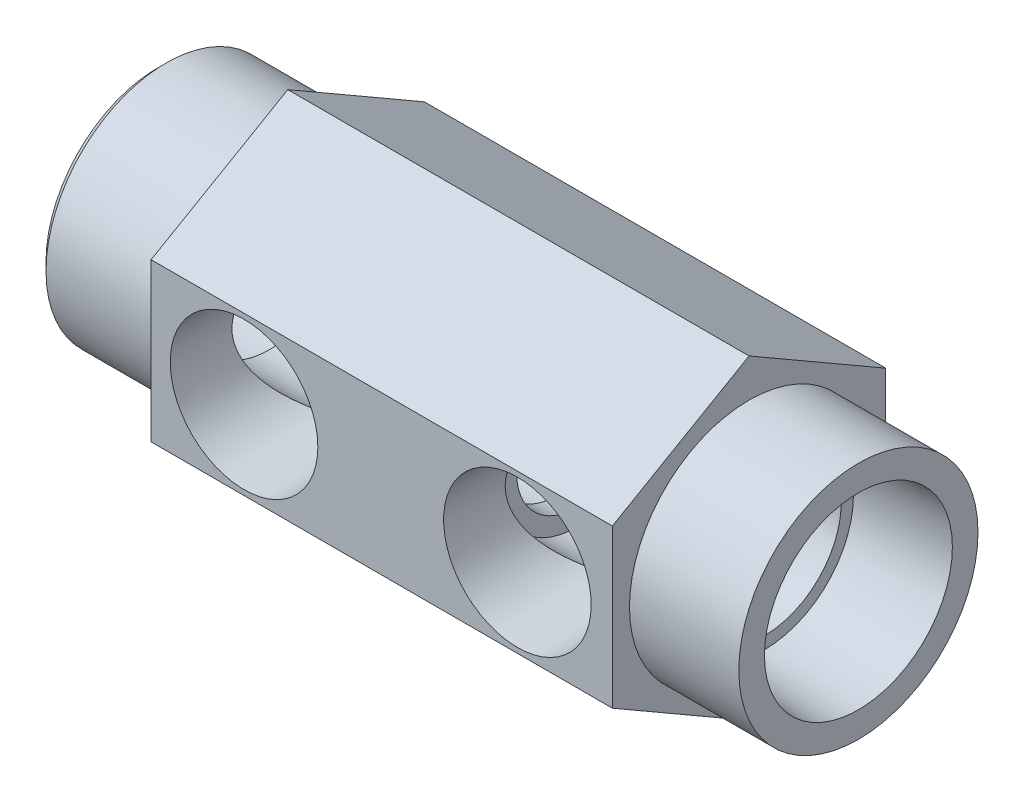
from build123d import *

# Parameters (mm, degrees)
BOSS_EXTRUDE1_DEPTH               = 42.8625
SKETCH2_R                         = 11.1125
BOSS_EXTRUDE2_DEPTH               = 53.0225
F_1_4_NPT_TAPPED_HOLE1_AT_2_COUNT = 2
F_1_4_NPT_TAPPED_HOLE1_AT_2_PITCH = 25.4
SKETCH12_R                        = 11.176
BOSS_EXTRUDE3_DEPTH               = 12.0523
FILLET1_R                         = 0.762
CHAMFER1_SIZE                     = 0.762


with BuildPart() as part:
    # Sketch1 → Boss-Extrude1 (new body)
    with BuildSketch(Plane(origin=(0, 0, 0), x_dir=(0, 0, -1), z_dir=(1, 0, 0))):
        Polygon((12.7, 7.332348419), (0, 14.664696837), (-12.7, 7.332348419), (-12.7, -7.332348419), (0, -14.664696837), (12.7, -7.332348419), align=None)
    extrude(amount=BOSS_EXTRUDE1_DEPTH)

    # Sketch2 → Boss-Extrude2 (add)
    with BuildSketch(Plane.ZY):
        Circle(SKETCH2_R)
    extrude(amount=-BOSS_EXTRUDE2_DEPTH)

    # Sketch3 → Cut-Revolve1 (revolve, cut)
    with BuildSketch(Plane(origin=(0, 0, 0), x_dir=(1, 0, 0), z_dir=(0, 1, 0)), mode=Mode.PRIVATE) as cut_revolve1_sk:
        Polygon((44.2849, 7.14375), (44.2849, 8.273331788), (53.0225, 8.73125), (53.0225, 0), (26.82875, 0), (26.82875, 7.14375), align=None)
    revolve(cut_revolve1_sk.sketch.rotate(Axis((0, 0, 0), (1, 0, 0)), 180), axis=Axis((0, 0, 0), (1, 0, 0)), mode=Mode.SUBTRACT)

    # Sketch4 → 1_4 NPT Tapped Hole1 (revolve, cut)
    with BuildSketch(Plane(origin=(8.636, 0, 12.7), x_dir=(0, -1, 0), z_dir=(1, 0, 0))):
        Polygon((0, 0), (0, 19.217347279), (5.5626, 15.875), (5.5626, 10.0203), (6.557978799, 10.0203), (6.858, 0), align=None)
    f_1_4_npt_tapped_hole1 = revolve(axis=Axis((8.636, 0, 19.05), (0, 0, -1)), mode=Mode.SUBTRACT)

    # 1_4 NPT Tapped Hole1 at 2: 1_4 NPT Tapped Hole1 ×2
    with Locations(*[(i * F_1_4_NPT_TAPPED_HOLE1_AT_2_PITCH, 0, 0) for i in range(1, F_1_4_NPT_TAPPED_HOLE1_AT_2_COUNT)]):
        add(f_1_4_npt_tapped_hole1, mode=Mode.SUBTRACT)

    # Sketch6 → 1_4 NPT Tapped Hole2 (revolve, cut)
    with BuildSketch(Plane(origin=(8.636, 0, -12.7), x_dir=(0, 1, 0), z_dir=(1, 0, 0))):
        Polygon((0, 0), (0, 20.411147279), (5.5626, 17.0688), (5.5626, 10.0203), (6.557978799, 10.0203), (6.858, 0), align=None)
    revolve(axis=Axis((8.636, 0, -19.05), (0, 0, 1)), mode=Mode.SUBTRACT)

    # Sketch12 → Boss-Extrude3 (add)
    with BuildSketch(Plane.ZY):
        Circle(SKETCH12_R)
    extrude(amount=BOSS_EXTRUDE3_DEPTH)

    # Fillet1
    fillet1_edges = [part.edges().sort_by_distance(p)[0] for p in [
        (0, 0, -11.176),
    ]]
    fillet(fillet1_edges, radius=FILLET1_R)

    # Chamfer1
    chamfer1_edges = [part.edges().sort_by_distance(p)[0] for p in [
        (-12.0523, 0, -11.176),
    ]]
    chamfer(chamfer1_edges, length=CHAMFER1_SIZE)

    # Sketch15 → 3_8 NPT Tapped Hole1 (revolve, cut)
    with BuildSketch(Plane(origin=(-12.0523, 0, 0), x_dir=(0, 0, 1), z_dir=(0, 1, 0))):
        Polygon((0, 0), (0, 26.9748), (7.1374, 26.9748), (7.1374, 10.33018), (8.263200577, 10.33018), (8.5725, 0), align=None)
    revolve(axis=Axis((-18.4023, 0, 0), (1, 0, 0)), mode=Mode.SUBTRACT)

    # Sketch18 → 1_4 NPT Tapped Hole3 (revolve, cut)
    with BuildSketch(Plane(origin=(14.9225, 0, 0), x_dir=(0, 0, 1), z_dir=(0, 1, 0))):
        Polygon((0, 0), (0, 38.1), (5.5626, 38.1), (5.5626, 10.0203), (6.557978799, 10.0203), (6.858, 0), align=None)
    revolve(axis=Axis((8.5725, 0, 0), (1, 0, 0)), mode=Mode.SUBTRACT)


solid = part.part
